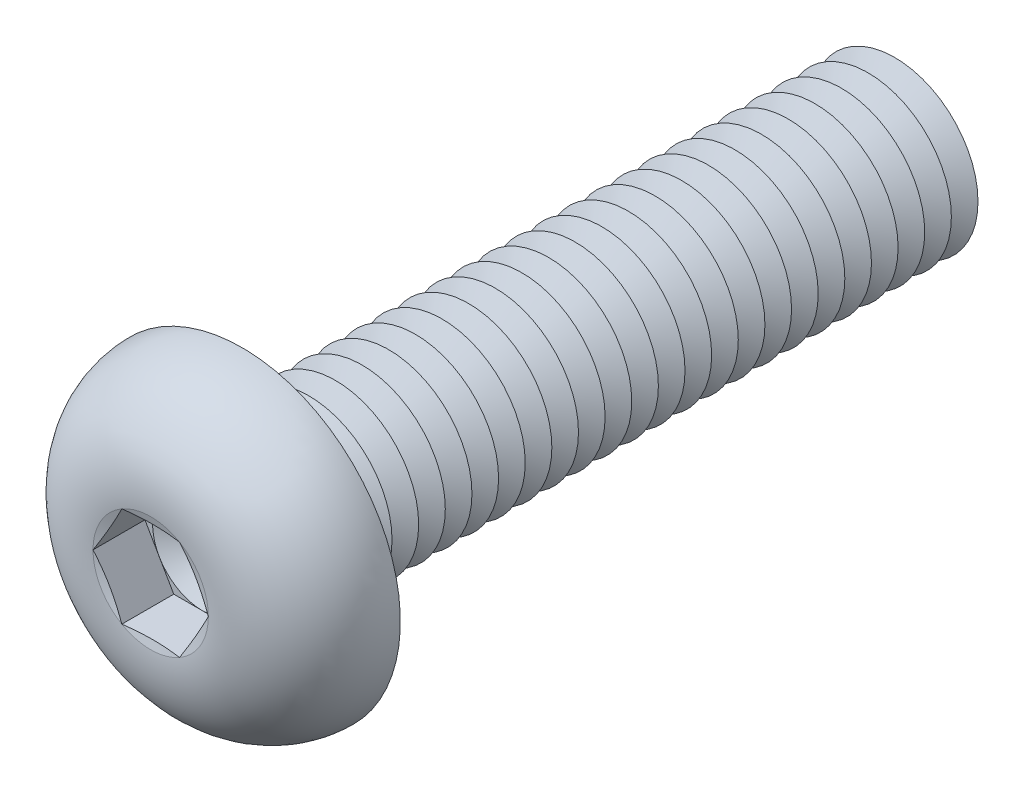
from build123d import *

# Parameters (mm, degrees)
FILLET1_R          = 0.4
LPATTERN1_COUNT    = 25
LPATTERN1_PITCH    = 0.8
CUT_EXTRUDE1_DEPTH = 1.56


with BuildPart() as part:
    # Sketch1 → Revolve1 (revolve)
    with BuildSketch(Plane(origin=(0, 0, 0), x_dir=(0, 0, -1), z_dir=(1, 0, 0)), mode=Mode.PRIVATE) as revolve1_sk:
        with BuildLine():
            Line((0, 2.5), (0, 4.75))
            ThreePointArc((0, 4.75), (-2.041477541, 3.848329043), (-2.75, 1.73205))
            Line((-2.75, 1.73205), (-2.517949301, 0.866025))
            Line((-2.517949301, 0.866025), (-2.75, 0.866025))
            Line((-2.75, 0.866025), (-2.75, 0))
            Line((-2.75, 0), (20, 0))
            Line((20, 0), (20, 2.5))
            Line((20, 2.5), (0, 2.5))
        make_face()
    revolve(revolve1_sk.sketch.rotate(Axis((0, 0, -20), (0, 0, 1)), 90), axis=Axis((0, 0, -20), (0, 0, 1)))

    # Fillet1
    fillet1_edges = [part.edges().sort_by_distance(p)[0] for p in [
        (2.5, 0, 0),
    ]]
    fillet(fillet1_edges, radius=FILLET1_R)

    # Sketch2 → Cut-Revolve1 (revolve, cut)
    with BuildSketch(Plane(origin=(0, 0, 0), x_dir=(0, 0, -1), z_dir=(1, 0, 0)), mode=Mode.PRIVATE) as cut_revolve1_sk:
        Polygon((19.6, 2.5), (20.4, 2.5), (20, 1.807179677), align=None)
    cut_revolve1 = revolve(cut_revolve1_sk.sketch.rotate(Axis((0, 0, -20), (0, 0, -1)), 270), axis=Axis((0, 0, -20), (0, 0, -1)), mode=Mode.SUBTRACT)

    # LPattern1: Cut-Revolve1 ×25
    with Locations(*[(0, 0, i * LPATTERN1_PITCH) for i in range(1, LPATTERN1_COUNT)]):
        add(cut_revolve1, mode=Mode.SUBTRACT)

    # Sketch3 → Cut-Extrude1 (cut)
    with BuildSketch(Plane.XY.offset(2.75)):
        Polygon((0.866025, 1.499999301), (-0.866025, 1.499999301), (-1.73205, 0), (-0.866025, -1.499999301), (0.866025, -1.499999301), (1.73205, 0), align=None)
    extrude(amount=-CUT_EXTRUDE1_DEPTH, mode=Mode.SUBTRACT)

    # Cut-Extrude2 cone 1 section (on through the dimple's axis) → Cut-Extrude2 (revolve, cut)
    with BuildSketch(Plane(origin=(0, 0, 1.19), x_dir=(0, -1, 0), z_dir=(1, 0, 0))):
        Polygon((0, 0), (1.499999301, 0), (0, 0.866025), align=None)
    revolve(axis=Axis((0, 0, 1.19), (0, 0, -1)), mode=Mode.SUBTRACT)


solid = part.part
